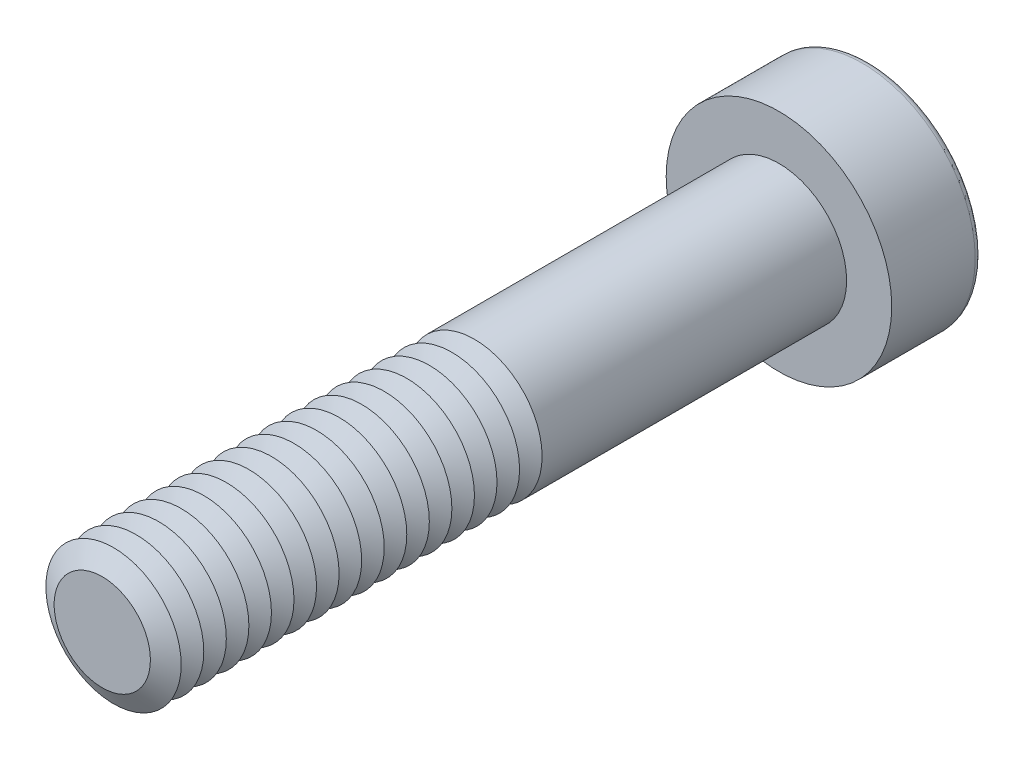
ISO-10303-21;
HEADER;
FILE_DESCRIPTION(('STEP AP214'),'2;1');
FILE_NAME('part.step','',(''),(''),'','','');
FILE_SCHEMA(('AUTOMOTIVE_DESIGN { 1 0 10303 214 1 1 1 1 }'));
ENDSEC;
DATA;
#1=APPLICATION_CONTEXT('core data for automotive mechanical design processes');
#2=APPLICATION_PROTOCOL_DEFINITION('international standard','automotive_design',2000,#1);
#3=PRODUCT_CONTEXT('',#1,'mechanical');
#4=PRODUCT('Part','Part','',(#3));
#5=PRODUCT_RELATED_PRODUCT_CATEGORY('part','',(#4));
#6=PRODUCT_DEFINITION_FORMATION('','',#4);
#7=PRODUCT_DEFINITION_CONTEXT('part definition',#1,'design');
#8=PRODUCT_DEFINITION('design','',#6,#7);
#9=PRODUCT_DEFINITION_SHAPE('','',#8);
#10=(LENGTH_UNIT() NAMED_UNIT(*) SI_UNIT(.MILLI.,.METRE.));
#11=(NAMED_UNIT(*) PLANE_ANGLE_UNIT() SI_UNIT($,.RADIAN.));
#12=(NAMED_UNIT(*) SI_UNIT($,.STERADIAN.) SOLID_ANGLE_UNIT());
#13=UNCERTAINTY_MEASURE_WITH_UNIT(LENGTH_MEASURE(1.E-05),#10,'distance_accuracy_value','');
#14=(GEOMETRIC_REPRESENTATION_CONTEXT(3) GLOBAL_UNCERTAINTY_ASSIGNED_CONTEXT((#13)) GLOBAL_UNIT_ASSIGNED_CONTEXT((#10,
#11,#12)) REPRESENTATION_CONTEXT('',''));
#15=CARTESIAN_POINT('',(0.,0.,0.));
#16=DIRECTION('',(0.,0.,1.));
#17=DIRECTION('',(1.,0.,0.));
#18=AXIS2_PLACEMENT_3D('',#15,#16,#17);
#19=CARTESIAN_POINT('',(0.,0.,26.5));
#20=DIRECTION('',(0.,0.,1.));
#21=DIRECTION('',(1.,0.,0.));
#22=AXIS2_PLACEMENT_3D('',#19,#20,#21);
#23=CONICAL_SURFACE('',#22,3.,1.0471975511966);
#24=CARTESIAN_POINT('',(0.,0.,26.));
#25=DIRECTION('',(0.,0.,1.));
#26=DIRECTION('',(1.,0.,0.));
#27=AXIS2_PLACEMENT_3D('',#24,#25,#26);
#28=CIRCLE('',#27,2.13397459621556);
#29=CARTESIAN_POINT('',(2.13397459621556,0.,26.));
#30=VERTEX_POINT('',#29);
#31=EDGE_CURVE('E313',#30,#30,#28,.T.);
#32=ORIENTED_EDGE('',*,*,#31,.T.);
#33=EDGE_LOOP('',(#32));
#34=FACE_BOUND('',#33,.T.);
#35=CARTESIAN_POINT('',(0.,0.,26.5));
#36=DIRECTION('',(0.,0.,1.));
#37=DIRECTION('',(1.,0.,0.));
#38=AXIS2_PLACEMENT_3D('',#35,#36,#37);
#39=CIRCLE('',#38,3.);
#40=CARTESIAN_POINT('',(3.,0.,26.5));
#41=VERTEX_POINT('',#40);
#42=EDGE_CURVE('E316',#41,#41,#39,.T.);
#43=ORIENTED_EDGE('',*,*,#42,.F.);
#44=EDGE_LOOP('',(#43));
#45=FACE_BOUND('',#44,.T.);
#46=ADVANCED_FACE('F39',(#34,#45),#23,.T.);
#47=CARTESIAN_POINT('',(0.,0.,26.));
#48=DIRECTION('',(0.,0.,-1.));
#49=DIRECTION('',(-1.,0.,0.));
#50=AXIS2_PLACEMENT_3D('',#47,#48,#49);
#51=CONICAL_SURFACE('',#50,2.13397459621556,1.0471975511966);
#52=CARTESIAN_POINT('',(0.,0.,25.5));
#53=DIRECTION('',(0.,0.,1.));
#54=DIRECTION('',(1.,0.,0.));
#55=AXIS2_PLACEMENT_3D('',#52,#53,#54);
#56=CIRCLE('',#55,3.);
#57=CARTESIAN_POINT('',(3.,0.,25.5));
#58=VERTEX_POINT('',#57);
#59=EDGE_CURVE('E324',#58,#58,#56,.T.);
#60=ORIENTED_EDGE('',*,*,#59,.T.);
#61=EDGE_LOOP('',(#60));
#62=FACE_BOUND('',#61,.T.);
#63=ORIENTED_EDGE('',*,*,#31,.F.);
#64=EDGE_LOOP('',(#63));
#65=FACE_BOUND('',#64,.T.);
#66=ADVANCED_FACE('F245',(#62,#65),#51,.T.);
#67=CARTESIAN_POINT('',(0.,0.,30.));
#68=DIRECTION('',(0.,0.,1.));
#69=DIRECTION('',(1.,0.,0.));
#70=AXIS2_PLACEMENT_3D('',#67,#68,#69);
#71=PLANE('',#70);
#72=CARTESIAN_POINT('',(0.,0.,30.));
#73=DIRECTION('',(0.,0.,1.));
#74=DIRECTION('',(1.,0.,0.));
#75=AXIS2_PLACEMENT_3D('',#72,#73,#74);
#76=CIRCLE('',#75,2.13397459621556);
#77=CARTESIAN_POINT('',(2.13397459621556,0.,30.));
#78=VERTEX_POINT('',#77);
#79=EDGE_CURVE('E174',#78,#78,#76,.T.);
#80=ORIENTED_EDGE('',*,*,#79,.T.);
#81=EDGE_LOOP('',(#80));
#82=FACE_BOUND('',#81,.T.);
#83=ADVANCED_FACE('F251',(#82),#71,.T.);
#84=CARTESIAN_POINT('',(0.,0.,30.));
#85=DIRECTION('',(0.,0.,-1.));
#86=DIRECTION('',(-1.,0.,0.));
#87=AXIS2_PLACEMENT_3D('',#84,#85,#86);
#88=CONICAL_SURFACE('',#87,2.13397459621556,1.0471975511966);
#89=CARTESIAN_POINT('',(0.,0.,29.5));
#90=DIRECTION('',(0.,0.,1.));
#91=DIRECTION('',(1.,0.,0.));
#92=AXIS2_PLACEMENT_3D('',#89,#90,#91);
#93=CIRCLE('',#92,3.);
#94=CARTESIAN_POINT('',(3.,0.,29.5));
#95=VERTEX_POINT('',#94);
#96=EDGE_CURVE('E291',#95,#95,#93,.T.);
#97=ORIENTED_EDGE('',*,*,#96,.T.);
#98=EDGE_LOOP('',(#97));
#99=FACE_BOUND('',#98,.T.);
#100=ORIENTED_EDGE('',*,*,#79,.F.);
#101=EDGE_LOOP('',(#100));
#102=FACE_BOUND('',#101,.T.);
#103=ADVANCED_FACE('F199',(#99,#102),#88,.T.);
#104=CARTESIAN_POINT('',(0.,0.,29.5));
#105=DIRECTION('',(0.,0.,1.));
#106=DIRECTION('',(1.,0.,0.));
#107=AXIS2_PLACEMENT_3D('',#104,#105,#106);
#108=CONICAL_SURFACE('',#107,3.,1.0471975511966);
#109=CARTESIAN_POINT('',(0.,0.,29.));
#110=DIRECTION('',(0.,0.,1.));
#111=DIRECTION('',(1.,0.,0.));
#112=AXIS2_PLACEMENT_3D('',#109,#110,#111);
#113=CIRCLE('',#112,2.13397459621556);
#114=CARTESIAN_POINT('',(2.13397459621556,0.,29.));
#115=VERTEX_POINT('',#114);
#116=EDGE_CURVE('E288',#115,#115,#113,.T.);
#117=ORIENTED_EDGE('',*,*,#116,.T.);
#118=EDGE_LOOP('',(#117));
#119=FACE_BOUND('',#118,.T.);
#120=ORIENTED_EDGE('',*,*,#96,.F.);
#121=EDGE_LOOP('',(#120));
#122=FACE_BOUND('',#121,.T.);
#123=ADVANCED_FACE('F277',(#119,#122),#108,.T.);
#124=CARTESIAN_POINT('',(0.,0.,29.));
#125=DIRECTION('',(0.,0.,-1.));
#126=DIRECTION('',(-1.,0.,0.));
#127=AXIS2_PLACEMENT_3D('',#124,#125,#126);
#128=CONICAL_SURFACE('',#127,2.13397459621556,1.0471975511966);
#129=CARTESIAN_POINT('',(0.,0.,28.5));
#130=DIRECTION('',(0.,0.,1.));
#131=DIRECTION('',(1.,0.,0.));
#132=AXIS2_PLACEMENT_3D('',#129,#130,#131);
#133=CIRCLE('',#132,3.);
#134=CARTESIAN_POINT('',(3.,0.,28.5));
#135=VERTEX_POINT('',#134);
#136=EDGE_CURVE('E299',#135,#135,#133,.T.);
#137=ORIENTED_EDGE('',*,*,#136,.T.);
#138=EDGE_LOOP('',(#137));
#139=FACE_BOUND('',#138,.T.);
#140=ORIENTED_EDGE('',*,*,#116,.F.);
#141=EDGE_LOOP('',(#140));
#142=FACE_BOUND('',#141,.T.);
#143=ADVANCED_FACE('F274',(#139,#142),#128,.T.);
#144=CARTESIAN_POINT('',(0.,0.,28.5));
#145=DIRECTION('',(0.,0.,1.));
#146=DIRECTION('',(1.,0.,0.));
#147=AXIS2_PLACEMENT_3D('',#144,#145,#146);
#148=CONICAL_SURFACE('',#147,3.,1.0471975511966);
#149=CARTESIAN_POINT('',(0.,0.,28.));
#150=DIRECTION('',(0.,0.,1.));
#151=DIRECTION('',(1.,0.,0.));
#152=AXIS2_PLACEMENT_3D('',#149,#150,#151);
#153=CIRCLE('',#152,2.13397459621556);
#154=CARTESIAN_POINT('',(2.13397459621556,0.,28.));
#155=VERTEX_POINT('',#154);
#156=EDGE_CURVE('E293',#155,#155,#153,.T.);
#157=ORIENTED_EDGE('',*,*,#156,.T.);
#158=EDGE_LOOP('',(#157));
#159=FACE_BOUND('',#158,.T.);
#160=ORIENTED_EDGE('',*,*,#136,.F.);
#161=EDGE_LOOP('',(#160));
#162=FACE_BOUND('',#161,.T.);
#163=ADVANCED_FACE('F270',(#159,#162),#148,.T.);
#164=CARTESIAN_POINT('',(0.,0.,28.));
#165=DIRECTION('',(0.,0.,-1.));
#166=DIRECTION('',(-1.,0.,0.));
#167=AXIS2_PLACEMENT_3D('',#164,#165,#166);
#168=CONICAL_SURFACE('',#167,2.13397459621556,1.0471975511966);
#169=CARTESIAN_POINT('',(0.,0.,27.5));
#170=DIRECTION('',(0.,0.,1.));
#171=DIRECTION('',(1.,0.,0.));
#172=AXIS2_PLACEMENT_3D('',#169,#170,#171);
#173=CIRCLE('',#172,3.);
#174=CARTESIAN_POINT('',(3.,0.,27.5));
#175=VERTEX_POINT('',#174);
#176=EDGE_CURVE('E309',#175,#175,#173,.T.);
#177=ORIENTED_EDGE('',*,*,#176,.T.);
#178=EDGE_LOOP('',(#177));
#179=FACE_BOUND('',#178,.T.);
#180=ORIENTED_EDGE('',*,*,#156,.F.);
#181=EDGE_LOOP('',(#180));
#182=FACE_BOUND('',#181,.T.);
#183=ADVANCED_FACE('F266',(#179,#182),#168,.T.);
#184=CARTESIAN_POINT('',(0.,0.,27.5));
#185=DIRECTION('',(0.,0.,1.));
#186=DIRECTION('',(1.,0.,0.));
#187=AXIS2_PLACEMENT_3D('',#184,#185,#186);
#188=CONICAL_SURFACE('',#187,3.,1.0471975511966);
#189=CARTESIAN_POINT('',(0.,0.,27.));
#190=DIRECTION('',(0.,0.,1.));
#191=DIRECTION('',(1.,0.,0.));
#192=AXIS2_PLACEMENT_3D('',#189,#190,#191);
#193=CIRCLE('',#192,2.13397459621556);
#194=CARTESIAN_POINT('',(2.13397459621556,0.,27.));
#195=VERTEX_POINT('',#194);
#196=EDGE_CURVE('E305',#195,#195,#193,.T.);
#197=ORIENTED_EDGE('',*,*,#196,.T.);
#198=EDGE_LOOP('',(#197));
#199=FACE_BOUND('',#198,.T.);
#200=ORIENTED_EDGE('',*,*,#176,.F.);
#201=EDGE_LOOP('',(#200));
#202=FACE_BOUND('',#201,.T.);
#203=ADVANCED_FACE('F262',(#199,#202),#188,.T.);
#204=CARTESIAN_POINT('',(0.,0.,27.));
#205=DIRECTION('',(0.,0.,-1.));
#206=DIRECTION('',(-1.,0.,0.));
#207=AXIS2_PLACEMENT_3D('',#204,#205,#206);
#208=CONICAL_SURFACE('',#207,2.13397459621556,1.0471975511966);
#209=ORIENTED_EDGE('',*,*,#42,.T.);
#210=EDGE_LOOP('',(#209));
#211=FACE_BOUND('',#210,.T.);
#212=ORIENTED_EDGE('',*,*,#196,.F.);
#213=EDGE_LOOP('',(#212));
#214=FACE_BOUND('',#213,.T.);
#215=ADVANCED_FACE('F258',(#211,#214),#208,.T.);
#216=CARTESIAN_POINT('',(0.,0.,25.5));
#217=DIRECTION('',(0.,0.,1.));
#218=DIRECTION('',(1.,0.,0.));
#219=AXIS2_PLACEMENT_3D('',#216,#217,#218);
#220=CONICAL_SURFACE('',#219,3.,1.0471975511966);
#221=CARTESIAN_POINT('',(0.,0.,25.));
#222=DIRECTION('',(0.,0.,1.));
#223=DIRECTION('',(1.,0.,0.));
#224=AXIS2_PLACEMENT_3D('',#221,#222,#223);
#225=CIRCLE('',#224,2.13397459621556);
#226=CARTESIAN_POINT('',(2.13397459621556,0.,25.));
#227=VERTEX_POINT('',#226);
#228=EDGE_CURVE('E320',#227,#227,#225,.T.);
#229=ORIENTED_EDGE('',*,*,#228,.T.);
#230=EDGE_LOOP('',(#229));
#231=FACE_BOUND('',#230,.T.);
#232=ORIENTED_EDGE('',*,*,#59,.F.);
#233=EDGE_LOOP('',(#232));
#234=FACE_BOUND('',#233,.T.);
#235=ADVANCED_FACE('F261',(#231,#234),#220,.T.);
#236=CARTESIAN_POINT('',(0.,0.,25.));
#237=DIRECTION('',(0.,0.,-1.));
#238=DIRECTION('',(-1.,0.,0.));
#239=AXIS2_PLACEMENT_3D('',#236,#237,#238);
#240=CONICAL_SURFACE('',#239,2.13397459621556,1.0471975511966);
#241=CARTESIAN_POINT('',(0.,0.,24.5));
#242=DIRECTION('',(0.,0.,1.));
#243=DIRECTION('',(1.,0.,0.));
#244=AXIS2_PLACEMENT_3D('',#241,#242,#243);
#245=CIRCLE('',#244,3.);
#246=CARTESIAN_POINT('',(3.,0.,24.5));
#247=VERTEX_POINT('',#246);
#248=EDGE_CURVE('E332',#247,#247,#245,.T.);
#249=ORIENTED_EDGE('',*,*,#248,.T.);
#250=EDGE_LOOP('',(#249));
#251=FACE_BOUND('',#250,.T.);
#252=ORIENTED_EDGE('',*,*,#228,.F.);
#253=EDGE_LOOP('',(#252));
#254=FACE_BOUND('',#253,.T.);
#255=ADVANCED_FACE('F511',(#251,#254),#240,.T.);
#256=CARTESIAN_POINT('',(0.,0.,24.5));
#257=DIRECTION('',(0.,0.,1.));
#258=DIRECTION('',(1.,0.,0.));
#259=AXIS2_PLACEMENT_3D('',#256,#257,#258);
#260=CONICAL_SURFACE('',#259,3.,1.0471975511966);
#261=CARTESIAN_POINT('',(0.,0.,24.));
#262=DIRECTION('',(0.,0.,1.));
#263=DIRECTION('',(1.,0.,0.));
#264=AXIS2_PLACEMENT_3D('',#261,#262,#263);
#265=CIRCLE('',#264,2.13397459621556);
#266=CARTESIAN_POINT('',(2.13397459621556,0.,24.));
#267=VERTEX_POINT('',#266);
#268=EDGE_CURVE('E328',#267,#267,#265,.T.);
#269=ORIENTED_EDGE('',*,*,#268,.T.);
#270=EDGE_LOOP('',(#269));
#271=FACE_BOUND('',#270,.T.);
#272=ORIENTED_EDGE('',*,*,#248,.F.);
#273=EDGE_LOOP('',(#272));
#274=FACE_BOUND('',#273,.T.);
#275=ADVANCED_FACE('F507',(#271,#274),#260,.T.);
#276=CARTESIAN_POINT('',(0.,0.,24.));
#277=DIRECTION('',(0.,0.,-1.));
#278=DIRECTION('',(-1.,0.,0.));
#279=AXIS2_PLACEMENT_3D('',#276,#277,#278);
#280=CONICAL_SURFACE('',#279,2.13397459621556,1.0471975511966);
#281=CARTESIAN_POINT('',(0.,0.,23.5));
#282=DIRECTION('',(0.,0.,1.));
#283=DIRECTION('',(1.,0.,0.));
#284=AXIS2_PLACEMENT_3D('',#281,#282,#283);
#285=CIRCLE('',#284,3.);
#286=CARTESIAN_POINT('',(3.,0.,23.5));
#287=VERTEX_POINT('',#286);
#288=EDGE_CURVE('E340',#287,#287,#285,.T.);
#289=ORIENTED_EDGE('',*,*,#288,.T.);
#290=EDGE_LOOP('',(#289));
#291=FACE_BOUND('',#290,.T.);
#292=ORIENTED_EDGE('',*,*,#268,.F.);
#293=EDGE_LOOP('',(#292));
#294=FACE_BOUND('',#293,.T.);
#295=ADVANCED_FACE('F503',(#291,#294),#280,.T.);
#296=CARTESIAN_POINT('',(0.,0.,23.5));
#297=DIRECTION('',(0.,0.,1.));
#298=DIRECTION('',(1.,0.,0.));
#299=AXIS2_PLACEMENT_3D('',#296,#297,#298);
#300=CONICAL_SURFACE('',#299,3.,1.0471975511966);
#301=CARTESIAN_POINT('',(0.,0.,23.));
#302=DIRECTION('',(0.,0.,1.));
#303=DIRECTION('',(1.,0.,0.));
#304=AXIS2_PLACEMENT_3D('',#301,#302,#303);
#305=CIRCLE('',#304,2.13397459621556);
#306=CARTESIAN_POINT('',(2.13397459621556,0.,23.));
#307=VERTEX_POINT('',#306);
#308=EDGE_CURVE('E336',#307,#307,#305,.T.);
#309=ORIENTED_EDGE('',*,*,#308,.T.);
#310=EDGE_LOOP('',(#309));
#311=FACE_BOUND('',#310,.T.);
#312=ORIENTED_EDGE('',*,*,#288,.F.);
#313=EDGE_LOOP('',(#312));
#314=FACE_BOUND('',#313,.T.);
#315=ADVANCED_FACE('F499',(#311,#314),#300,.T.);
#316=CARTESIAN_POINT('',(0.,0.,23.));
#317=DIRECTION('',(0.,0.,-1.));
#318=DIRECTION('',(-1.,0.,0.));
#319=AXIS2_PLACEMENT_3D('',#316,#317,#318);
#320=CONICAL_SURFACE('',#319,2.13397459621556,1.0471975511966);
#321=CARTESIAN_POINT('',(0.,0.,22.5));
#322=DIRECTION('',(0.,0.,1.));
#323=DIRECTION('',(1.,0.,0.));
#324=AXIS2_PLACEMENT_3D('',#321,#322,#323);
#325=CIRCLE('',#324,3.);
#326=CARTESIAN_POINT('',(3.,0.,22.5));
#327=VERTEX_POINT('',#326);
#328=EDGE_CURVE('E348',#327,#327,#325,.T.);
#329=ORIENTED_EDGE('',*,*,#328,.T.);
#330=EDGE_LOOP('',(#329));
#331=FACE_BOUND('',#330,.T.);
#332=ORIENTED_EDGE('',*,*,#308,.F.);
#333=EDGE_LOOP('',(#332));
#334=FACE_BOUND('',#333,.T.);
#335=ADVANCED_FACE('F495',(#331,#334),#320,.T.);
#336=CARTESIAN_POINT('',(0.,0.,22.5));
#337=DIRECTION('',(0.,0.,1.));
#338=DIRECTION('',(1.,0.,0.));
#339=AXIS2_PLACEMENT_3D('',#336,#337,#338);
#340=CONICAL_SURFACE('',#339,3.,1.0471975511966);
#341=CARTESIAN_POINT('',(0.,0.,22.));
#342=DIRECTION('',(0.,0.,1.));
#343=DIRECTION('',(1.,0.,0.));
#344=AXIS2_PLACEMENT_3D('',#341,#342,#343);
#345=CIRCLE('',#344,2.13397459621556);
#346=CARTESIAN_POINT('',(2.13397459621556,0.,22.));
#347=VERTEX_POINT('',#346);
#348=EDGE_CURVE('E344',#347,#347,#345,.T.);
#349=ORIENTED_EDGE('',*,*,#348,.T.);
#350=EDGE_LOOP('',(#349));
#351=FACE_BOUND('',#350,.T.);
#352=ORIENTED_EDGE('',*,*,#328,.F.);
#353=EDGE_LOOP('',(#352));
#354=FACE_BOUND('',#353,.T.);
#355=ADVANCED_FACE('F491',(#351,#354),#340,.T.);
#356=CARTESIAN_POINT('',(0.,0.,22.));
#357=DIRECTION('',(0.,0.,-1.));
#358=DIRECTION('',(-1.,0.,0.));
#359=AXIS2_PLACEMENT_3D('',#356,#357,#358);
#360=CONICAL_SURFACE('',#359,2.13397459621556,1.0471975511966);
#361=CARTESIAN_POINT('',(0.,0.,21.5));
#362=DIRECTION('',(0.,0.,1.));
#363=DIRECTION('',(1.,0.,0.));
#364=AXIS2_PLACEMENT_3D('',#361,#362,#363);
#365=CIRCLE('',#364,3.);
#366=CARTESIAN_POINT('',(3.,0.,21.5));
#367=VERTEX_POINT('',#366);
#368=EDGE_CURVE('E356',#367,#367,#365,.T.);
#369=ORIENTED_EDGE('',*,*,#368,.T.);
#370=EDGE_LOOP('',(#369));
#371=FACE_BOUND('',#370,.T.);
#372=ORIENTED_EDGE('',*,*,#348,.F.);
#373=EDGE_LOOP('',(#372));
#374=FACE_BOUND('',#373,.T.);
#375=ADVANCED_FACE('F487',(#371,#374),#360,.T.);
#376=CARTESIAN_POINT('',(0.,0.,21.5));
#377=DIRECTION('',(0.,0.,1.));
#378=DIRECTION('',(1.,0.,0.));
#379=AXIS2_PLACEMENT_3D('',#376,#377,#378);
#380=CONICAL_SURFACE('',#379,3.,1.0471975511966);
#381=CARTESIAN_POINT('',(0.,0.,21.));
#382=DIRECTION('',(0.,0.,1.));
#383=DIRECTION('',(1.,0.,0.));
#384=AXIS2_PLACEMENT_3D('',#381,#382,#383);
#385=CIRCLE('',#384,2.13397459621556);
#386=CARTESIAN_POINT('',(2.13397459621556,0.,21.));
#387=VERTEX_POINT('',#386);
#388=EDGE_CURVE('E352',#387,#387,#385,.T.);
#389=ORIENTED_EDGE('',*,*,#388,.T.);
#390=EDGE_LOOP('',(#389));
#391=FACE_BOUND('',#390,.T.);
#392=ORIENTED_EDGE('',*,*,#368,.F.);
#393=EDGE_LOOP('',(#392));
#394=FACE_BOUND('',#393,.T.);
#395=ADVANCED_FACE('F483',(#391,#394),#380,.T.);
#396=CARTESIAN_POINT('',(0.,0.,21.));
#397=DIRECTION('',(0.,0.,-1.));
#398=DIRECTION('',(-1.,0.,0.));
#399=AXIS2_PLACEMENT_3D('',#396,#397,#398);
#400=CONICAL_SURFACE('',#399,2.13397459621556,1.0471975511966);
#401=CARTESIAN_POINT('',(0.,0.,20.5));
#402=DIRECTION('',(0.,0.,1.));
#403=DIRECTION('',(1.,0.,0.));
#404=AXIS2_PLACEMENT_3D('',#401,#402,#403);
#405=CIRCLE('',#404,3.);
#406=CARTESIAN_POINT('',(3.,0.,20.5));
#407=VERTEX_POINT('',#406);
#408=EDGE_CURVE('E363',#407,#407,#405,.T.);
#409=ORIENTED_EDGE('',*,*,#408,.T.);
#410=EDGE_LOOP('',(#409));
#411=FACE_BOUND('',#410,.T.);
#412=ORIENTED_EDGE('',*,*,#388,.F.);
#413=EDGE_LOOP('',(#412));
#414=FACE_BOUND('',#413,.T.);
#415=ADVANCED_FACE('F479',(#411,#414),#400,.T.);
#416=CARTESIAN_POINT('',(0.,0.,20.5));
#417=DIRECTION('',(0.,0.,1.));
#418=DIRECTION('',(1.,0.,0.));
#419=AXIS2_PLACEMENT_3D('',#416,#417,#418);
#420=CONICAL_SURFACE('',#419,3.,1.0471975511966);
#421=CARTESIAN_POINT('',(0.,0.,20.));
#422=DIRECTION('',(0.,0.,1.));
#423=DIRECTION('',(1.,0.,0.));
#424=AXIS2_PLACEMENT_3D('',#421,#422,#423);
#425=CIRCLE('',#424,2.13397459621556);
#426=CARTESIAN_POINT('',(2.13397459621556,0.,20.));
#427=VERTEX_POINT('',#426);
#428=EDGE_CURVE('E360',#427,#427,#425,.T.);
#429=ORIENTED_EDGE('',*,*,#428,.T.);
#430=EDGE_LOOP('',(#429));
#431=FACE_BOUND('',#430,.T.);
#432=ORIENTED_EDGE('',*,*,#408,.F.);
#433=EDGE_LOOP('',(#432));
#434=FACE_BOUND('',#433,.T.);
#435=ADVANCED_FACE('F475',(#431,#434),#420,.T.);
#436=CARTESIAN_POINT('',(0.,0.,20.));
#437=DIRECTION('',(0.,0.,-1.));
#438=DIRECTION('',(-1.,0.,0.));
#439=AXIS2_PLACEMENT_3D('',#436,#437,#438);
#440=CONICAL_SURFACE('',#439,2.13397459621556,1.0471975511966);
#441=CARTESIAN_POINT('',(0.,0.,19.5));
#442=DIRECTION('',(0.,0.,1.));
#443=DIRECTION('',(1.,0.,0.));
#444=AXIS2_PLACEMENT_3D('',#441,#442,#443);
#445=CIRCLE('',#444,3.);
#446=CARTESIAN_POINT('',(3.,0.,19.5));
#447=VERTEX_POINT('',#446);
#448=EDGE_CURVE('E371',#447,#447,#445,.T.);
#449=ORIENTED_EDGE('',*,*,#448,.T.);
#450=EDGE_LOOP('',(#449));
#451=FACE_BOUND('',#450,.T.);
#452=ORIENTED_EDGE('',*,*,#428,.F.);
#453=EDGE_LOOP('',(#452));
#454=FACE_BOUND('',#453,.T.);
#455=ADVANCED_FACE('F471',(#451,#454),#440,.T.);
#456=CARTESIAN_POINT('',(0.,0.,19.5));
#457=DIRECTION('',(0.,0.,1.));
#458=DIRECTION('',(1.,0.,0.));
#459=AXIS2_PLACEMENT_3D('',#456,#457,#458);
#460=CONICAL_SURFACE('',#459,3.,1.0471975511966);
#461=CARTESIAN_POINT('',(0.,0.,19.));
#462=DIRECTION('',(0.,0.,1.));
#463=DIRECTION('',(1.,0.,0.));
#464=AXIS2_PLACEMENT_3D('',#461,#462,#463);
#465=CIRCLE('',#464,2.13397459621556);
#466=CARTESIAN_POINT('',(2.13397459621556,0.,19.));
#467=VERTEX_POINT('',#466);
#468=EDGE_CURVE('E367',#467,#467,#465,.T.);
#469=ORIENTED_EDGE('',*,*,#468,.T.);
#470=EDGE_LOOP('',(#469));
#471=FACE_BOUND('',#470,.T.);
#472=ORIENTED_EDGE('',*,*,#448,.F.);
#473=EDGE_LOOP('',(#472));
#474=FACE_BOUND('',#473,.T.);
#475=ADVANCED_FACE('F467',(#471,#474),#460,.T.);
#476=CARTESIAN_POINT('',(0.,0.,19.));
#477=DIRECTION('',(0.,0.,-1.));
#478=DIRECTION('',(-1.,0.,0.));
#479=AXIS2_PLACEMENT_3D('',#476,#477,#478);
#480=CONICAL_SURFACE('',#479,2.13397459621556,1.0471975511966);
#481=CARTESIAN_POINT('',(0.,0.,18.5));
#482=DIRECTION('',(0.,0.,1.));
#483=DIRECTION('',(1.,0.,0.));
#484=AXIS2_PLACEMENT_3D('',#481,#482,#483);
#485=CIRCLE('',#484,3.);
#486=CARTESIAN_POINT('',(3.,0.,18.5));
#487=VERTEX_POINT('',#486);
#488=EDGE_CURVE('E378',#487,#487,#485,.T.);
#489=ORIENTED_EDGE('',*,*,#488,.T.);
#490=EDGE_LOOP('',(#489));
#491=FACE_BOUND('',#490,.T.);
#492=ORIENTED_EDGE('',*,*,#468,.F.);
#493=EDGE_LOOP('',(#492));
#494=FACE_BOUND('',#493,.T.);
#495=ADVANCED_FACE('F463',(#491,#494),#480,.T.);
#496=CARTESIAN_POINT('',(0.,0.,18.5));
#497=DIRECTION('',(0.,0.,1.));
#498=DIRECTION('',(1.,0.,0.));
#499=AXIS2_PLACEMENT_3D('',#496,#497,#498);
#500=CONICAL_SURFACE('',#499,3.,1.0471975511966);
#501=CARTESIAN_POINT('',(0.,0.,18.));
#502=DIRECTION('',(0.,0.,1.));
#503=DIRECTION('',(1.,0.,0.));
#504=AXIS2_PLACEMENT_3D('',#501,#502,#503);
#505=CIRCLE('',#504,2.13397459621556);
#506=CARTESIAN_POINT('',(2.13397459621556,0.,18.));
#507=VERTEX_POINT('',#506);
#508=EDGE_CURVE('E375',#507,#507,#505,.T.);
#509=ORIENTED_EDGE('',*,*,#508,.T.);
#510=EDGE_LOOP('',(#509));
#511=FACE_BOUND('',#510,.T.);
#512=ORIENTED_EDGE('',*,*,#488,.F.);
#513=EDGE_LOOP('',(#512));
#514=FACE_BOUND('',#513,.T.);
#515=ADVANCED_FACE('F459',(#511,#514),#500,.T.);
#516=CARTESIAN_POINT('',(0.,0.,18.));
#517=DIRECTION('',(0.,0.,-1.));
#518=DIRECTION('',(-1.,0.,0.));
#519=AXIS2_PLACEMENT_3D('',#516,#517,#518);
#520=CONICAL_SURFACE('',#519,2.13397459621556,1.0471975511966);
#521=CARTESIAN_POINT('',(0.,0.,17.5));
#522=DIRECTION('',(0.,0.,1.));
#523=DIRECTION('',(1.,0.,0.));
#524=AXIS2_PLACEMENT_3D('',#521,#522,#523);
#525=CIRCLE('',#524,3.);
#526=CARTESIAN_POINT('',(3.,0.,17.5));
#527=VERTEX_POINT('',#526);
#528=EDGE_CURVE('E386',#527,#527,#525,.T.);
#529=ORIENTED_EDGE('',*,*,#528,.T.);
#530=EDGE_LOOP('',(#529));
#531=FACE_BOUND('',#530,.T.);
#532=ORIENTED_EDGE('',*,*,#508,.F.);
#533=EDGE_LOOP('',(#532));
#534=FACE_BOUND('',#533,.T.);
#535=ADVANCED_FACE('F455',(#531,#534),#520,.T.);
#536=CARTESIAN_POINT('',(0.,0.,17.5));
#537=DIRECTION('',(0.,0.,1.));
#538=DIRECTION('',(1.,0.,0.));
#539=AXIS2_PLACEMENT_3D('',#536,#537,#538);
#540=CONICAL_SURFACE('',#539,3.,1.0471975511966);
#541=CARTESIAN_POINT('',(0.,0.,17.));
#542=DIRECTION('',(0.,0.,1.));
#543=DIRECTION('',(1.,0.,0.));
#544=AXIS2_PLACEMENT_3D('',#541,#542,#543);
#545=CIRCLE('',#544,2.13397459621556);
#546=CARTESIAN_POINT('',(2.13397459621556,0.,17.));
#547=VERTEX_POINT('',#546);
#548=EDGE_CURVE('E382',#547,#547,#545,.T.);
#549=ORIENTED_EDGE('',*,*,#548,.T.);
#550=EDGE_LOOP('',(#549));
#551=FACE_BOUND('',#550,.T.);
#552=ORIENTED_EDGE('',*,*,#528,.F.);
#553=EDGE_LOOP('',(#552));
#554=FACE_BOUND('',#553,.T.);
#555=ADVANCED_FACE('F451',(#551,#554),#540,.T.);
#556=CARTESIAN_POINT('',(0.,0.,17.));
#557=DIRECTION('',(0.,0.,-1.));
#558=DIRECTION('',(-1.,0.,0.));
#559=AXIS2_PLACEMENT_3D('',#556,#557,#558);
#560=CONICAL_SURFACE('',#559,2.13397459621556,1.0471975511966);
#561=CARTESIAN_POINT('',(0.,0.,16.5));
#562=DIRECTION('',(0.,0.,1.));
#563=DIRECTION('',(1.,0.,0.));
#564=AXIS2_PLACEMENT_3D('',#561,#562,#563);
#565=CIRCLE('',#564,3.);
#566=CARTESIAN_POINT('',(3.,0.,16.5));
#567=VERTEX_POINT('',#566);
#568=EDGE_CURVE('E394',#567,#567,#565,.T.);
#569=ORIENTED_EDGE('',*,*,#568,.T.);
#570=EDGE_LOOP('',(#569));
#571=FACE_BOUND('',#570,.T.);
#572=ORIENTED_EDGE('',*,*,#548,.F.);
#573=EDGE_LOOP('',(#572));
#574=FACE_BOUND('',#573,.T.);
#575=ADVANCED_FACE('F447',(#571,#574),#560,.T.);
#576=CARTESIAN_POINT('',(0.,0.,16.5));
#577=DIRECTION('',(0.,0.,1.));
#578=DIRECTION('',(1.,0.,0.));
#579=AXIS2_PLACEMENT_3D('',#576,#577,#578);
#580=CONICAL_SURFACE('',#579,3.,1.0471975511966);
#581=CARTESIAN_POINT('',(0.,0.,16.));
#582=DIRECTION('',(0.,0.,1.));
#583=DIRECTION('',(1.,0.,0.));
#584=AXIS2_PLACEMENT_3D('',#581,#582,#583);
#585=CIRCLE('',#584,2.13397459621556);
#586=CARTESIAN_POINT('',(2.13397459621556,0.,16.));
#587=VERTEX_POINT('',#586);
#588=EDGE_CURVE('E390',#587,#587,#585,.T.);
#589=ORIENTED_EDGE('',*,*,#588,.T.);
#590=EDGE_LOOP('',(#589));
#591=FACE_BOUND('',#590,.T.);
#592=ORIENTED_EDGE('',*,*,#568,.F.);
#593=EDGE_LOOP('',(#592));
#594=FACE_BOUND('',#593,.T.);
#595=ADVANCED_FACE('F443',(#591,#594),#580,.T.);
#596=CARTESIAN_POINT('',(0.,0.,16.));
#597=DIRECTION('',(0.,0.,-1.));
#598=DIRECTION('',(-1.,0.,0.));
#599=AXIS2_PLACEMENT_3D('',#596,#597,#598);
#600=CONICAL_SURFACE('',#599,2.13397459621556,1.0471975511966);
#601=CARTESIAN_POINT('',(0.,0.,15.5));
#602=DIRECTION('',(0.,0.,1.));
#603=DIRECTION('',(1.,0.,0.));
#604=AXIS2_PLACEMENT_3D('',#601,#602,#603);
#605=CIRCLE('',#604,3.);
#606=CARTESIAN_POINT('',(3.,0.,15.5));
#607=VERTEX_POINT('',#606);
#608=EDGE_CURVE('E402',#607,#607,#605,.T.);
#609=ORIENTED_EDGE('',*,*,#608,.T.);
#610=EDGE_LOOP('',(#609));
#611=FACE_BOUND('',#610,.T.);
#612=ORIENTED_EDGE('',*,*,#588,.F.);
#613=EDGE_LOOP('',(#612));
#614=FACE_BOUND('',#613,.T.);
#615=ADVANCED_FACE('F439',(#611,#614),#600,.T.);
#616=CARTESIAN_POINT('',(0.,0.,15.5));
#617=DIRECTION('',(0.,0.,1.));
#618=DIRECTION('',(1.,0.,0.));
#619=AXIS2_PLACEMENT_3D('',#616,#617,#618);
#620=CONICAL_SURFACE('',#619,3.,1.0471975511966);
#621=CARTESIAN_POINT('',(0.,0.,15.));
#622=DIRECTION('',(0.,0.,1.));
#623=DIRECTION('',(1.,0.,0.));
#624=AXIS2_PLACEMENT_3D('',#621,#622,#623);
#625=CIRCLE('',#624,2.13397459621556);
#626=CARTESIAN_POINT('',(2.13397459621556,0.,15.));
#627=VERTEX_POINT('',#626);
#628=EDGE_CURVE('E398',#627,#627,#625,.T.);
#629=ORIENTED_EDGE('',*,*,#628,.T.);
#630=EDGE_LOOP('',(#629));
#631=FACE_BOUND('',#630,.T.);
#632=ORIENTED_EDGE('',*,*,#608,.F.);
#633=EDGE_LOOP('',(#632));
#634=FACE_BOUND('',#633,.T.);
#635=ADVANCED_FACE('F434',(#631,#634),#620,.T.);
#636=CARTESIAN_POINT('',(0.,0.,15.));
#637=DIRECTION('',(0.,0.,-1.));
#638=DIRECTION('',(-1.,0.,0.));
#639=AXIS2_PLACEMENT_3D('',#636,#637,#638);
#640=CONICAL_SURFACE('',#639,2.13397459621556,1.0471975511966);
#641=CARTESIAN_POINT('',(0.,0.,14.5));
#642=DIRECTION('',(0.,0.,1.));
#643=DIRECTION('',(1.,0.,0.));
#644=AXIS2_PLACEMENT_3D('',#641,#642,#643);
#645=CIRCLE('',#644,3.);
#646=CARTESIAN_POINT('',(3.,0.,14.5));
#647=VERTEX_POINT('',#646);
#648=EDGE_CURVE('E414',#647,#647,#645,.T.);
#649=ORIENTED_EDGE('',*,*,#648,.T.);
#650=EDGE_LOOP('',(#649));
#651=FACE_BOUND('',#650,.T.);
#652=ORIENTED_EDGE('',*,*,#628,.F.);
#653=EDGE_LOOP('',(#652));
#654=FACE_BOUND('',#653,.T.);
#655=ADVANCED_FACE('F420',(#651,#654),#640,.T.);
#656=CARTESIAN_POINT('',(0.,0.,14.5));
#657=DIRECTION('',(0.,0.,1.));
#658=DIRECTION('',(1.,0.,0.));
#659=AXIS2_PLACEMENT_3D('',#656,#657,#658);
#660=CONICAL_SURFACE('',#659,3.,1.0471975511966);
#661=CARTESIAN_POINT('',(0.,0.,14.));
#662=DIRECTION('',(0.,0.,1.));
#663=DIRECTION('',(1.,0.,0.));
#664=AXIS2_PLACEMENT_3D('',#661,#662,#663);
#665=CIRCLE('',#664,2.13397459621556);
#666=CARTESIAN_POINT('',(2.13397459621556,0.,14.));
#667=VERTEX_POINT('',#666);
#668=EDGE_CURVE('E406',#667,#667,#665,.T.);
#669=ORIENTED_EDGE('',*,*,#668,.T.);
#670=EDGE_LOOP('',(#669));
#671=FACE_BOUND('',#670,.T.);
#672=ORIENTED_EDGE('',*,*,#648,.F.);
#673=EDGE_LOOP('',(#672));
#674=FACE_BOUND('',#673,.T.);
#675=ADVANCED_FACE('F423',(#671,#674),#660,.T.);
#676=CARTESIAN_POINT('',(0.,0.,14.));
#677=DIRECTION('',(0.,0.,-1.));
#678=DIRECTION('',(-1.,0.,0.));
#679=AXIS2_PLACEMENT_3D('',#676,#677,#678);
#680=CONICAL_SURFACE('',#679,2.13397459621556,1.0471975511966);
#681=CARTESIAN_POINT('',(0.,0.,13.5));
#682=DIRECTION('',(0.,0.,1.));
#683=DIRECTION('',(1.,0.,0.));
#684=AXIS2_PLACEMENT_3D('',#681,#682,#683);
#685=CIRCLE('',#684,3.);
#686=CARTESIAN_POINT('',(3.,0.,13.5));
#687=VERTEX_POINT('',#686);
#688=EDGE_CURVE('E410',#687,#687,#685,.T.);
#689=ORIENTED_EDGE('',*,*,#688,.T.);
#690=EDGE_LOOP('',(#689));
#691=FACE_BOUND('',#690,.T.);
#692=ORIENTED_EDGE('',*,*,#668,.F.);
#693=EDGE_LOOP('',(#692));
#694=FACE_BOUND('',#693,.T.);
#695=ADVANCED_FACE('F425',(#691,#694),#680,.T.);
#696=CARTESIAN_POINT('',(0.,0.,-1.));
#697=DIRECTION('',(0.,0.,-1.));
#698=DIRECTION('',(-1.,0.,0.));
#699=AXIS2_PLACEMENT_3D('',#696,#697,#698);
#700=CONICAL_SURFACE('',#699,2.,1.0471975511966);
#701=CARTESIAN_POINT('',(0.,0.,0.154700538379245));
#702=VERTEX_POINT('',#701);
#703=VERTEX_LOOP('',#702);
#704=FACE_BOUND('',#703,.T.);
#705=CARTESIAN_POINT('',(0.,0.,-1.));
#706=DIRECTION('',(0.,0.,-1.));
#707=DIRECTION('',(-1.,0.,0.));
#708=AXIS2_PLACEMENT_3D('',#705,#706,#707);
#709=CIRCLE('',#708,2.);
#710=CARTESIAN_POINT('',(-1.73205080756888,0.999999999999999,-1.));
#711=VERTEX_POINT('',#710);
#712=CARTESIAN_POINT('',(0.,2.,-1.));
#713=VERTEX_POINT('',#712);
#714=EDGE_CURVE('E149',#711,#713,#709,.T.);
#715=ORIENTED_EDGE('',*,*,#714,.T.);
#716=CARTESIAN_POINT('',(0.,0.,-1.));
#717=DIRECTION('',(0.,0.,-1.));
#718=DIRECTION('',(-1.,0.,0.));
#719=AXIS2_PLACEMENT_3D('',#716,#717,#718);
#720=CIRCLE('',#719,2.);
#721=CARTESIAN_POINT('',(1.73205080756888,1.,-1.));
#722=VERTEX_POINT('',#721);
#723=EDGE_CURVE('E54',#713,#722,#720,.T.);
#724=ORIENTED_EDGE('',*,*,#723,.T.);
#725=CARTESIAN_POINT('',(1.73205080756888,-0.999999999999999,-1.));
#726=VERTEX_POINT('',#725);
#727=EDGE_CURVE('E1026',#722,#726,#720,.T.);
#728=ORIENTED_EDGE('',*,*,#727,.T.);
#729=CARTESIAN_POINT('',(0.,-2.,-1.));
#730=VERTEX_POINT('',#729);
#731=EDGE_CURVE('E1024',#726,#730,#720,.T.);
#732=ORIENTED_EDGE('',*,*,#731,.T.);
#733=CARTESIAN_POINT('',(-1.73205080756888,-0.999999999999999,-1.));
#734=VERTEX_POINT('',#733);
#735=EDGE_CURVE('E1018',#730,#734,#720,.T.);
#736=ORIENTED_EDGE('',*,*,#735,.T.);
#737=EDGE_CURVE('E1016',#734,#711,#720,.T.);
#738=ORIENTED_EDGE('',*,*,#737,.T.);
#739=EDGE_LOOP('',(#715,#724,#728,#732,#736,#738));
#740=FACE_BOUND('',#739,.T.);
#741=ADVANCED_FACE('F201',(#704,#740),#700,.F.);
#742=CARTESIAN_POINT('',(0.,0.,-1.));
#743=DIRECTION('',(0.,0.,-1.));
#744=DIRECTION('',(-1.,0.,0.));
#745=AXIS2_PLACEMENT_3D('',#742,#743,#744);
#746=PLANE('',#745);
#747=ORIENTED_EDGE('',*,*,#723,.F.);
#748=DIRECTION('',(1.,0.,0.));
#749=VECTOR('',#748,1.);
#750=CARTESIAN_POINT('',(-1.15470053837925,2.,-1.));
#751=LINE('',#750,#749);
#752=CARTESIAN_POINT('',(1.15470053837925,2.,-1.));
#753=VERTEX_POINT('',#752);
#754=EDGE_CURVE('E1062',#713,#753,#751,.T.);
#755=ORIENTED_EDGE('',*,*,#754,.T.);
#756=DIRECTION('',(0.5,-0.866025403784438,0.));
#757=VECTOR('',#756,1.);
#758=CARTESIAN_POINT('',(1.15470053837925,2.,-1.));
#759=LINE('',#758,#757);
#760=EDGE_CURVE('E155',#753,#722,#759,.T.);
#761=ORIENTED_EDGE('',*,*,#760,.T.);
#762=EDGE_LOOP('',(#747,#755,#761));
#763=FACE_BOUND('',#762,.T.);
#764=ADVANCED_FACE('F606',(#763),#746,.T.);
#765=ORIENTED_EDGE('',*,*,#727,.F.);
#766=CARTESIAN_POINT('',(2.3094010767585,0.,-1.));
#767=VERTEX_POINT('',#766);
#768=EDGE_CURVE('E1067',#722,#767,#759,.T.);
#769=ORIENTED_EDGE('',*,*,#768,.T.);
#770=DIRECTION('',(-0.5,-0.866025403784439,0.));
#771=VECTOR('',#770,1.);
#772=CARTESIAN_POINT('',(2.3094010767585,0.,-1.));
#773=LINE('',#772,#771);
#774=EDGE_CURVE('E1040',#767,#726,#773,.T.);
#775=ORIENTED_EDGE('',*,*,#774,.T.);
#776=EDGE_LOOP('',(#765,#769,#775));
#777=FACE_BOUND('',#776,.T.);
#778=ADVANCED_FACE('F616',(#777),#746,.T.);
#779=ORIENTED_EDGE('',*,*,#731,.F.);
#780=CARTESIAN_POINT('',(1.15470053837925,-2.,-1.));
#781=VERTEX_POINT('',#780);
#782=EDGE_CURVE('E1042',#726,#781,#773,.T.);
#783=ORIENTED_EDGE('',*,*,#782,.T.);
#784=DIRECTION('',(-1.,0.,0.));
#785=VECTOR('',#784,1.);
#786=CARTESIAN_POINT('',(1.15470053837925,-2.,-1.));
#787=LINE('',#786,#785);
#788=EDGE_CURVE('E990',#781,#730,#787,.T.);
#789=ORIENTED_EDGE('',*,*,#788,.T.);
#790=EDGE_LOOP('',(#779,#783,#789));
#791=FACE_BOUND('',#790,.T.);
#792=ADVANCED_FACE('F626',(#791),#746,.T.);
#793=ORIENTED_EDGE('',*,*,#735,.F.);
#794=CARTESIAN_POINT('',(-1.15470053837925,-2.,-1.));
#795=VERTEX_POINT('',#794);
#796=EDGE_CURVE('E1037',#730,#795,#787,.T.);
#797=ORIENTED_EDGE('',*,*,#796,.T.);
#798=DIRECTION('',(-0.5,0.866025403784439,0.));
#799=VECTOR('',#798,1.);
#800=CARTESIAN_POINT('',(-1.15470053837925,-2.,-1.));
#801=LINE('',#800,#799);
#802=EDGE_CURVE('E1039',#795,#734,#801,.T.);
#803=ORIENTED_EDGE('',*,*,#802,.T.);
#804=EDGE_LOOP('',(#793,#797,#803));
#805=FACE_BOUND('',#804,.T.);
#806=ADVANCED_FACE('F634',(#805),#746,.T.);
#807=ORIENTED_EDGE('',*,*,#737,.F.);
#808=CARTESIAN_POINT('',(-2.3094010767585,0.,-1.));
#809=VERTEX_POINT('',#808);
#810=EDGE_CURVE('E1043',#734,#809,#801,.T.);
#811=ORIENTED_EDGE('',*,*,#810,.T.);
#812=DIRECTION('',(0.5,0.866025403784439,0.));
#813=VECTOR('',#812,1.);
#814=CARTESIAN_POINT('',(-2.3094010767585,0.,-1.));
#815=LINE('',#814,#813);
#816=EDGE_CURVE('E158',#809,#711,#815,.T.);
#817=ORIENTED_EDGE('',*,*,#816,.T.);
#818=EDGE_LOOP('',(#807,#811,#817));
#819=FACE_BOUND('',#818,.T.);
#820=ADVANCED_FACE('F231',(#819),#746,.T.);
#821=ORIENTED_EDGE('',*,*,#714,.F.);
#822=CARTESIAN_POINT('',(-1.15470053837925,2.,-1.));
#823=VERTEX_POINT('',#822);
#824=EDGE_CURVE('E1050',#711,#823,#815,.T.);
#825=ORIENTED_EDGE('',*,*,#824,.T.);
#826=EDGE_CURVE('E1063',#823,#713,#751,.T.);
#827=ORIENTED_EDGE('',*,*,#826,.T.);
#828=EDGE_LOOP('',(#821,#825,#827));
#829=FACE_BOUND('',#828,.T.);
#830=ADVANCED_FACE('F618',(#829),#746,.T.);
#831=CARTESIAN_POINT('',(-1.15470053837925,2.,-1.));
#832=DIRECTION('',(0.,1.,0.));
#833=DIRECTION('',(0.,0.,1.));
#834=AXIS2_PLACEMENT_3D('',#831,#832,#833);
#835=PLANE('',#834);
#836=DIRECTION('',(0.,0.,-1.));
#837=VECTOR('',#836,1.);
#838=CARTESIAN_POINT('',(-1.15470053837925,2.,-1.));
#839=LINE('',#838,#837);
#840=CARTESIAN_POINT('',(-1.15470053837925,2.,-4.));
#841=VERTEX_POINT('',#840);
#842=EDGE_CURVE('E147',#823,#841,#839,.T.);
#843=ORIENTED_EDGE('',*,*,#842,.T.);
#844=CARTESIAN_POINT('',(-3.01440758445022,2.,-4.35051689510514));
#845=CARTESIAN_POINT('',(-2.92409762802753,2.,-4.33035636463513));
#846=CARTESIAN_POINT('',(-2.83373054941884,2.,-4.31045254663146));
#847=CARTESIAN_POINT('',(-2.65285291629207,2.,-4.27128852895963));
#848=CARTESIAN_POINT('',(-2.562342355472,2.,-4.25202835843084));
#849=CARTESIAN_POINT('',(-2.29037985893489,2.,-4.19537300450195));
#850=CARTESIAN_POINT('',(-2.10868043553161,2.,-4.15914446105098));
#851=CARTESIAN_POINT('',(-1.74597297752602,2.,-4.09171688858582));
#852=CARTESIAN_POINT('',(-1.56497266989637,2.,-4.06047686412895));
#853=CARTESIAN_POINT('',(-1.20186568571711,2.,-4.00513826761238));
#854=CARTESIAN_POINT('',(-1.01975924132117,2.,-3.98103824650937));
#855=CARTESIAN_POINT('',(-0.744747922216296,2.,-3.9525901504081));
#856=CARTESIAN_POINT('',(-0.652245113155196,2.,-3.9443671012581));
#857=CARTESIAN_POINT('',(-0.467020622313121,2.,-3.93099406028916));
#858=CARTESIAN_POINT('',(-0.374298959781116,2.,-3.92584380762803));
#859=CARTESIAN_POINT('',(-0.188764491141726,2.,-3.91891540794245));
#860=CARTESIAN_POINT('',(-0.0959517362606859,2.,-3.91713591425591));
#861=CARTESIAN_POINT('',(0.0896753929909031,2.,-3.91705786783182));
#862=CARTESIAN_POINT('',(0.182489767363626,2.,-3.91875932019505));
#863=CARTESIAN_POINT('',(0.368369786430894,2.,-3.92554892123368));
#864=CARTESIAN_POINT('',(0.461434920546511,2.,-3.93065079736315));
#865=CARTESIAN_POINT('',(0.647346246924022,2.,-3.94395663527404));
#866=CARTESIAN_POINT('',(0.740192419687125,2.,-3.95216086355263));
#867=CARTESIAN_POINT('',(1.01841374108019,2.,-3.98081777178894));
#868=CARTESIAN_POINT('',(1.2033713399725,2.,-4.00531018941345));
#869=CARTESIAN_POINT('',(1.57694396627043,2.,-4.06236202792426));
#870=CARTESIAN_POINT('',(1.76552771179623,2.,-4.09511615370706));
#871=CARTESIAN_POINT('',(2.14178491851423,2.,-4.1655706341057));
#872=CARTESIAN_POINT('',(2.32945822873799,2.,-4.20327178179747));
#873=CARTESIAN_POINT('',(2.70417911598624,2.,-4.28188312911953));
#874=CARTESIAN_POINT('',(2.89122649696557,2.,-4.32279425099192));
#875=CARTESIAN_POINT('',(3.26484478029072,2.,-4.40674298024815));
#876=CARTESIAN_POINT('',(3.45141567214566,2.,-4.44978063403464));
#877=CARTESIAN_POINT('',(3.821938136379,2.,-4.53678178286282));
#878=CARTESIAN_POINT('',(4.00589388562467,2.,-4.58072756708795));
#879=CARTESIAN_POINT('',(4.37356350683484,2.,-4.66963526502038));
#880=CARTESIAN_POINT('',(4.55727737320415,2.,-4.71459720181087));
#881=CARTESIAN_POINT('',(4.9242660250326,2.,-4.80519833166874));
#882=CARTESIAN_POINT('',(5.10754106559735,2.,-4.85083649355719));
#883=CARTESIAN_POINT('',(5.47394280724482,2.,-4.94267693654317));
#884=CARTESIAN_POINT('',(5.65706951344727,2.,-4.98887919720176));
#885=CARTESIAN_POINT('',(5.84014583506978,2.,-5.03527803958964));
#886=B_SPLINE_CURVE_WITH_KNOTS('',3,(#844,#845,#846,#847,#848,#849,#850,#851,#852,#853,#854,
#855,#856,#857,#858,#859,#860,#861,#862,#863,#864,#865,#866,#867,#868,#869,#870,#871,#872,#873,
#874,#875,#876,#877,#878,#879,#880,#881,#882,#883,#884,#885),.UNSPECIFIED.,.F.,.F.,(4,2,2,2,2,2,
2,2,2,2,2,2,2,2,2,2,2,2,2,2,4),(0.,0.277597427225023,0.555207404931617,1.11099118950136,
1.66194208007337,2.21278108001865,2.49134108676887,2.76987744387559,3.04830249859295,
3.32672796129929,3.60628428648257,3.88586463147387,4.44532615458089,5.0194589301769,
5.59368385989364,6.16807437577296,6.74247743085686,7.30986991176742,7.87727529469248,
8.44388991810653,9.01048407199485),.UNSPECIFIED.);
#887=CARTESIAN_POINT('',(1.15470053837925,2.,-4.));
#888=VERTEX_POINT('',#887);
#889=EDGE_CURVE('E124',#841,#888,#886,.T.);
#890=ORIENTED_EDGE('',*,*,#889,.T.);
#891=DIRECTION('',(0.,0.,-1.));
#892=VECTOR('',#891,1.);
#893=CARTESIAN_POINT('',(1.15470053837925,2.,-1.));
#894=LINE('',#893,#892);
#895=EDGE_CURVE('E143',#753,#888,#894,.T.);
#896=ORIENTED_EDGE('',*,*,#895,.F.);
#897=ORIENTED_EDGE('',*,*,#754,.F.);
#898=ORIENTED_EDGE('',*,*,#826,.F.);
#899=EDGE_LOOP('',(#843,#890,#896,#897,#898));
#900=FACE_BOUND('',#899,.T.);
#901=ADVANCED_FACE('F141',(#900),#835,.F.);
#902=CARTESIAN_POINT('',(1.15470053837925,2.,-1.));
#903=DIRECTION('',(0.866025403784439,0.5,0.));
#904=DIRECTION('',(-0.5,0.866025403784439,0.));
#905=AXIS2_PLACEMENT_3D('',#902,#903,#904);
#906=PLANE('',#905);
#907=ORIENTED_EDGE('',*,*,#895,.T.);
#908=CARTESIAN_POINT('',(1.15458506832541,2.0002,-4.00003094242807));
#909=CARTESIAN_POINT('',(1.20254643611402,1.91712847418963,-3.98717294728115));
#910=CARTESIAN_POINT('',(1.25059477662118,1.83390630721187,-3.97549990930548));
#911=CARTESIAN_POINT('',(1.3468611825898,1.66716800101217,-3.95499135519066));
#912=CARTESIAN_POINT('',(1.39507930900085,1.58365175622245,-3.94615699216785));
#913=CARTESIAN_POINT('',(1.49139287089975,1.41683177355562,-3.93184164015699));
#914=CARTESIAN_POINT('',(1.53948765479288,1.33352916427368,-3.92634357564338));
#915=CARTESIAN_POINT('',(1.63573857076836,1.1668176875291,-3.91897122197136));
#916=CARTESIAN_POINT('',(1.68389468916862,1.08340884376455,-3.91709623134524));
#917=CARTESIAN_POINT('',(1.78020692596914,0.916591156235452,-3.91709623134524));
#918=CARTESIAN_POINT('',(1.82836304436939,0.833182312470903,-3.91897122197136));
#919=CARTESIAN_POINT('',(1.92461396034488,0.666470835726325,-3.92634357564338));
#920=CARTESIAN_POINT('',(1.972708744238,0.583168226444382,-3.93184164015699));
#921=CARTESIAN_POINT('',(2.06902230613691,0.416348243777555,-3.94615699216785));
#922=CARTESIAN_POINT('',(2.11724043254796,0.332831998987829,-3.95499135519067));
#923=CARTESIAN_POINT('',(2.21350683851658,0.16609369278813,-3.97549990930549));
#924=CARTESIAN_POINT('',(2.26155517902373,0.0828715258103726,-3.98717294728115));
#925=CARTESIAN_POINT('',(2.30951654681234,-0.000199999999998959,-4.00003094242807));
#926=B_SPLINE_CURVE_WITH_KNOTS('',3,(#908,#909,#910,#911,#912,#913,#914,#915,#916,#917,#918,
#919,#920,#921,#922,#923,#924,#925),.UNSPECIFIED.,.F.,.F.,(4,2,2,2,2,2,2,2,4),(0.,
0.29035724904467,0.580832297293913,0.869807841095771,1.15872743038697,1.44764701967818,
1.73662256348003,2.02709761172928,2.31745486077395),.UNSPECIFIED.);
#927=CARTESIAN_POINT('',(2.3094010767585,0.,-4.));
#928=VERTEX_POINT('',#927);
#929=EDGE_CURVE('E11',#888,#928,#926,.T.);
#930=ORIENTED_EDGE('',*,*,#929,.T.);
#931=DIRECTION('',(0.,0.,-1.));
#932=VECTOR('',#931,1.);
#933=CARTESIAN_POINT('',(2.3094010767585,0.,-1.));
#934=LINE('',#933,#932);
#935=EDGE_CURVE('E157',#767,#928,#934,.T.);
#936=ORIENTED_EDGE('',*,*,#935,.F.);
#937=ORIENTED_EDGE('',*,*,#768,.F.);
#938=ORIENTED_EDGE('',*,*,#760,.F.);
#939=EDGE_LOOP('',(#907,#930,#936,#937,#938));
#940=FACE_BOUND('',#939,.T.);
#941=ADVANCED_FACE('F152',(#940),#906,.F.);
#942=CARTESIAN_POINT('',(2.3094010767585,0.,-1.));
#943=DIRECTION('',(0.866025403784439,-0.5,0.));
#944=DIRECTION('',(0.5,0.866025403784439,0.));
#945=AXIS2_PLACEMENT_3D('',#942,#943,#944);
#946=PLANE('',#945);
#947=ORIENTED_EDGE('',*,*,#935,.T.);
#948=CARTESIAN_POINT('',(2.30951654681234,0.000200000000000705,-4.00003094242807));
#949=CARTESIAN_POINT('',(2.26155517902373,-0.0828715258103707,-3.98717294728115));
#950=CARTESIAN_POINT('',(2.21350683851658,-0.166093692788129,-3.97549990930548));
#951=CARTESIAN_POINT('',(2.11724043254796,-0.332831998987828,-3.95499135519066));
#952=CARTESIAN_POINT('',(2.06902230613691,-0.416348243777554,-3.94615699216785));
#953=CARTESIAN_POINT('',(1.972708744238,-0.583168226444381,-3.93184164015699));
#954=CARTESIAN_POINT('',(1.92461396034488,-0.666470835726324,-3.92634357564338));
#955=CARTESIAN_POINT('',(1.82836304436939,-0.833182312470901,-3.91897122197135));
#956=CARTESIAN_POINT('',(1.78020692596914,-0.91659115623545,-3.91709623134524));
#957=CARTESIAN_POINT('',(1.68389468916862,-1.08340884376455,-3.91709623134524));
#958=CARTESIAN_POINT('',(1.63573857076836,-1.1668176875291,-3.91897122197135));
#959=CARTESIAN_POINT('',(1.53948765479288,-1.33352916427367,-3.92634357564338));
#960=CARTESIAN_POINT('',(1.49139287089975,-1.41683177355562,-3.93184164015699));
#961=CARTESIAN_POINT('',(1.39507930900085,-1.58365175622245,-3.94615699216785));
#962=CARTESIAN_POINT('',(1.3468611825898,-1.66716800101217,-3.95499135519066));
#963=CARTESIAN_POINT('',(1.25059477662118,-1.83390630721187,-3.97549990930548));
#964=CARTESIAN_POINT('',(1.20254643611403,-1.91712847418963,-3.98717294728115));
#965=CARTESIAN_POINT('',(1.15458506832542,-2.0002,-4.00003094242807));
#966=B_SPLINE_CURVE_WITH_KNOTS('',3,(#948,#949,#950,#951,#952,#953,#954,#955,#956,#957,#958,
#959,#960,#961,#962,#963,#964,#965),.UNSPECIFIED.,.F.,.F.,(4,2,2,2,2,2,2,2,4),(0.,
0.290357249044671,0.580832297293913,0.869807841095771,1.15872743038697,1.44764701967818,
1.73662256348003,2.02709761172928,2.31745486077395),.UNSPECIFIED.);
#967=CARTESIAN_POINT('',(1.15470053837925,-2.,-4.));
#968=VERTEX_POINT('',#967);
#969=EDGE_CURVE('E173',#928,#968,#966,.T.);
#970=ORIENTED_EDGE('',*,*,#969,.T.);
#971=DIRECTION('',(0.,0.,-1.));
#972=VECTOR('',#971,1.);
#973=CARTESIAN_POINT('',(1.15470053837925,-2.,-1.));
#974=LINE('',#973,#972);
#975=EDGE_CURVE('E985',#781,#968,#974,.T.);
#976=ORIENTED_EDGE('',*,*,#975,.F.);
#977=ORIENTED_EDGE('',*,*,#782,.F.);
#978=ORIENTED_EDGE('',*,*,#774,.F.);
#979=EDGE_LOOP('',(#947,#970,#976,#977,#978));
#980=FACE_BOUND('',#979,.T.);
#981=ADVANCED_FACE('F191',(#980),#946,.F.);
#982=CARTESIAN_POINT('',(1.15470053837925,-2.,-1.));
#983=DIRECTION('',(0.,-1.,0.));
#984=DIRECTION('',(0.,0.,-1.));
#985=AXIS2_PLACEMENT_3D('',#982,#983,#984);
#986=PLANE('',#985);
#987=ORIENTED_EDGE('',*,*,#975,.T.);
#988=CARTESIAN_POINT('',(-3.01440758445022,-2.,-4.35051689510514));
#989=CARTESIAN_POINT('',(-2.92409762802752,-2.,-4.33035636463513));
#990=CARTESIAN_POINT('',(-2.83373054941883,-2.,-4.31045254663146));
#991=CARTESIAN_POINT('',(-2.65285291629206,-2.,-4.27128852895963));
#992=CARTESIAN_POINT('',(-2.562342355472,-2.,-4.25202835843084));
#993=CARTESIAN_POINT('',(-2.29037985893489,-2.,-4.19537300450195));
#994=CARTESIAN_POINT('',(-2.10868043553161,-2.,-4.15914446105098));
#995=CARTESIAN_POINT('',(-1.74597297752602,-2.,-4.09171688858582));
#996=CARTESIAN_POINT('',(-1.56497266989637,-2.,-4.06047686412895));
#997=CARTESIAN_POINT('',(-1.20186568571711,-2.,-4.00513826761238));
#998=CARTESIAN_POINT('',(-1.01975924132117,-2.,-3.98103824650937));
#999=CARTESIAN_POINT('',(-0.744747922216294,-2.,-3.9525901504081));
#1000=CARTESIAN_POINT('',(-0.652245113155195,-2.,-3.9443671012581));
#1001=CARTESIAN_POINT('',(-0.46702062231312,-2.,-3.93099406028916));
#1002=CARTESIAN_POINT('',(-0.374298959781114,-2.,-3.92584380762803));
#1003=CARTESIAN_POINT('',(-0.188764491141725,-2.,-3.91891540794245));
#1004=CARTESIAN_POINT('',(-0.0959517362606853,-2.,-3.91713591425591));
#1005=CARTESIAN_POINT('',(0.0896753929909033,-2.,-3.91705786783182));
#1006=CARTESIAN_POINT('',(0.182489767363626,-2.,-3.91875932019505));
#1007=CARTESIAN_POINT('',(0.368369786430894,-2.,-3.92554892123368));
#1008=CARTESIAN_POINT('',(0.461434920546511,-2.,-3.93065079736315));
#1009=CARTESIAN_POINT('',(0.647346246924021,-2.,-3.94395663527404));
#1010=CARTESIAN_POINT('',(0.740192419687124,-2.,-3.95216086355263));
#1011=CARTESIAN_POINT('',(1.01841374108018,-2.,-3.98081777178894));
#1012=CARTESIAN_POINT('',(1.2033713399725,-2.,-4.00531018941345));
#1013=CARTESIAN_POINT('',(1.57694396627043,-2.,-4.06236202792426));
#1014=CARTESIAN_POINT('',(1.76552771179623,-2.,-4.09511615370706));
#1015=CARTESIAN_POINT('',(2.14178491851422,-2.,-4.1655706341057));
#1016=CARTESIAN_POINT('',(2.32945822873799,-2.,-4.20327178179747));
#1017=CARTESIAN_POINT('',(2.70417911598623,-2.,-4.28188312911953));
#1018=CARTESIAN_POINT('',(2.89122649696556,-2.,-4.32279425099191));
#1019=CARTESIAN_POINT('',(3.26484478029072,-2.,-4.40674298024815));
#1020=CARTESIAN_POINT('',(3.45141567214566,-2.,-4.44978063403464));
#1021=CARTESIAN_POINT('',(3.821938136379,-2.,-4.53678178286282));
#1022=CARTESIAN_POINT('',(4.00589388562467,-2.,-4.58072756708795));
#1023=CARTESIAN_POINT('',(4.37356350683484,-2.,-4.66963526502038));
#1024=CARTESIAN_POINT('',(4.55727737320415,-2.,-4.71459720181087));
#1025=CARTESIAN_POINT('',(4.9242660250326,-2.,-4.80519833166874));
#1026=CARTESIAN_POINT('',(5.10754106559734,-2.,-4.85083649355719));
#1027=CARTESIAN_POINT('',(5.47394280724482,-2.,-4.94267693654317));
#1028=CARTESIAN_POINT('',(5.65706951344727,-2.,-4.98887919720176));
#1029=CARTESIAN_POINT('',(5.84014583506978,-2.,-5.03527803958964));
#1030=B_SPLINE_CURVE_WITH_KNOTS('',3,(#988,#989,#990,#991,#992,#993,#994,#995,#996,#997,#998,
#999,#1000,#1001,#1002,#1003,#1004,#1005,#1006,#1007,#1008,#1009,#1010,#1011,#1012,#1013,#1014,
#1015,#1016,#1017,#1018,#1019,#1020,#1021,#1022,#1023,#1024,#1025,#1026,#1027,#1028,#1029),
.UNSPECIFIED.,.F.,.F.,(4,2,2,2,2,2,2,2,2,2,2,2,2,2,2,2,2,2,2,2,4),(0.,0.277597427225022,
0.555207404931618,1.11099118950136,1.66194208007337,2.21278108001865,2.49134108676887,
2.76987744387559,3.04830249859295,3.32672796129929,3.60628428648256,3.88586463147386,
4.44532615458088,5.01945893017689,5.59368385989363,6.16807437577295,6.74247743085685,
7.30986991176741,7.87727529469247,8.44388991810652,9.01048407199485),.UNSPECIFIED.);
#1031=CARTESIAN_POINT('',(-1.15470053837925,-2.,-4.));
#1032=VERTEX_POINT('',#1031);
#1033=EDGE_CURVE('E184',#968,#1032,#1030,.F.);
#1034=ORIENTED_EDGE('',*,*,#1033,.T.);
#1035=DIRECTION('',(0.,0.,-1.));
#1036=VECTOR('',#1035,1.);
#1037=CARTESIAN_POINT('',(-1.15470053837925,-2.,-1.));
#1038=LINE('',#1037,#1036);
#1039=EDGE_CURVE('E992',#795,#1032,#1038,.T.);
#1040=ORIENTED_EDGE('',*,*,#1039,.F.);
#1041=ORIENTED_EDGE('',*,*,#796,.F.);
#1042=ORIENTED_EDGE('',*,*,#788,.F.);
#1043=EDGE_LOOP('',(#987,#1034,#1040,#1041,#1042));
#1044=FACE_BOUND('',#1043,.T.);
#1045=ADVANCED_FACE('F234',(#1044),#986,.F.);
#1046=CARTESIAN_POINT('',(-1.15470053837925,-2.,-1.));
#1047=DIRECTION('',(-0.866025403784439,-0.5,0.));
#1048=DIRECTION('',(0.5,-0.866025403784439,0.));
#1049=AXIS2_PLACEMENT_3D('',#1046,#1047,#1048);
#1050=PLANE('',#1049);
#1051=ORIENTED_EDGE('',*,*,#1039,.T.);
#1052=CARTESIAN_POINT('',(-1.15458506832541,-2.0002,-4.00003094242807));
#1053=CARTESIAN_POINT('',(-1.20254643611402,-1.91712847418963,-3.98717294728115));
#1054=CARTESIAN_POINT('',(-1.25059477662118,-1.83390630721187,-3.97549990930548));
#1055=CARTESIAN_POINT('',(-1.34686118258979,-1.66716800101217,-3.95499135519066));
#1056=CARTESIAN_POINT('',(-1.39507930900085,-1.58365175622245,-3.94615699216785));
#1057=CARTESIAN_POINT('',(-1.49139287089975,-1.41683177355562,-3.93184164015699));
#1058=CARTESIAN_POINT('',(-1.53948765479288,-1.33352916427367,-3.92634357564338));
#1059=CARTESIAN_POINT('',(-1.63573857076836,-1.1668176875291,-3.91897122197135));
#1060=CARTESIAN_POINT('',(-1.68389468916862,-1.08340884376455,-3.91709623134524));
#1061=CARTESIAN_POINT('',(-1.78020692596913,-0.91659115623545,-3.91709623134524));
#1062=CARTESIAN_POINT('',(-1.82836304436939,-0.833182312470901,-3.91897122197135));
#1063=CARTESIAN_POINT('',(-1.92461396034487,-0.666470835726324,-3.92634357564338));
#1064=CARTESIAN_POINT('',(-1.972708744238,-0.583168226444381,-3.93184164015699));
#1065=CARTESIAN_POINT('',(-2.0690223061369,-0.416348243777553,-3.94615699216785));
#1066=CARTESIAN_POINT('',(-2.11724043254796,-0.332831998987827,-3.95499135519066));
#1067=CARTESIAN_POINT('',(-2.21350683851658,-0.166093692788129,-3.97549990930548));
#1068=CARTESIAN_POINT('',(-2.26155517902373,-0.0828715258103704,-3.98717294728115));
#1069=CARTESIAN_POINT('',(-2.30951654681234,0.000200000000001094,-4.00003094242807));
#1070=B_SPLINE_CURVE_WITH_KNOTS('',3,(#1052,#1053,#1054,#1055,#1056,#1057,#1058,#1059,#1060,
#1061,#1062,#1063,#1064,#1065,#1066,#1067,#1068,#1069),.UNSPECIFIED.,.F.,.F.,(4,2,2,2,2,2,2,2,
4),(0.,0.290357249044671,0.580832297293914,0.869807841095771,1.15872743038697,1.44764701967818,
1.73662256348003,2.02709761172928,2.31745486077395),.UNSPECIFIED.);
#1071=CARTESIAN_POINT('',(-2.3094010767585,0.,-4.));
#1072=VERTEX_POINT('',#1071);
#1073=EDGE_CURVE('E208',#1032,#1072,#1070,.T.);
#1074=ORIENTED_EDGE('',*,*,#1073,.T.);
#1075=DIRECTION('',(0.,0.,-1.));
#1076=VECTOR('',#1075,1.);
#1077=CARTESIAN_POINT('',(-2.3094010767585,0.,-1.));
#1078=LINE('',#1077,#1076);
#1079=EDGE_CURVE('E996',#809,#1072,#1078,.T.);
#1080=ORIENTED_EDGE('',*,*,#1079,.F.);
#1081=ORIENTED_EDGE('',*,*,#810,.F.);
#1082=ORIENTED_EDGE('',*,*,#802,.F.);
#1083=EDGE_LOOP('',(#1051,#1074,#1080,#1081,#1082));
#1084=FACE_BOUND('',#1083,.T.);
#1085=ADVANCED_FACE('F229',(#1084),#1050,.F.);
#1086=CARTESIAN_POINT('',(-2.3094010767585,0.,-1.));
#1087=DIRECTION('',(-0.866025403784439,0.5,0.));
#1088=DIRECTION('',(-0.5,-0.866025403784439,0.));
#1089=AXIS2_PLACEMENT_3D('',#1086,#1087,#1088);
#1090=PLANE('',#1089);
#1091=ORIENTED_EDGE('',*,*,#1079,.T.);
#1092=CARTESIAN_POINT('',(-2.30951654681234,-0.00019999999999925,-4.00003094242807));
#1093=CARTESIAN_POINT('',(-2.26155517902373,0.0828715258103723,-3.98717294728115));
#1094=CARTESIAN_POINT('',(-2.21350683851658,0.16609369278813,-3.97549990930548));
#1095=CARTESIAN_POINT('',(-2.11724043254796,0.332831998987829,-3.95499135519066));
#1096=CARTESIAN_POINT('',(-2.0690223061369,0.416348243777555,-3.94615699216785));
#1097=CARTESIAN_POINT('',(-1.972708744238,0.583168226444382,-3.93184164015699));
#1098=CARTESIAN_POINT('',(-1.92461396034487,0.666470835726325,-3.92634357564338));
#1099=CARTESIAN_POINT('',(-1.82836304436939,0.833182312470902,-3.91897122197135));
#1100=CARTESIAN_POINT('',(-1.78020692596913,0.916591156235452,-3.91709623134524));
#1101=CARTESIAN_POINT('',(-1.68389468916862,1.08340884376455,-3.91709623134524));
#1102=CARTESIAN_POINT('',(-1.63573857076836,1.1668176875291,-3.91897122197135));
#1103=CARTESIAN_POINT('',(-1.53948765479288,1.33352916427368,-3.92634357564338));
#1104=CARTESIAN_POINT('',(-1.49139287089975,1.41683177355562,-3.93184164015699));
#1105=CARTESIAN_POINT('',(-1.39507930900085,1.58365175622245,-3.94615699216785));
#1106=CARTESIAN_POINT('',(-1.3468611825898,1.66716800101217,-3.95499135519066));
#1107=CARTESIAN_POINT('',(-1.25059477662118,1.83390630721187,-3.97549990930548));
#1108=CARTESIAN_POINT('',(-1.20254643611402,1.91712847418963,-3.98717294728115));
#1109=CARTESIAN_POINT('',(-1.15458506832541,2.0002,-4.00003094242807));
#1110=B_SPLINE_CURVE_WITH_KNOTS('',3,(#1092,#1093,#1094,#1095,#1096,#1097,#1098,#1099,#1100,
#1101,#1102,#1103,#1104,#1105,#1106,#1107,#1108,#1109),.UNSPECIFIED.,.F.,.F.,(4,2,2,2,2,2,2,2,
4),(0.,0.29035724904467,0.580832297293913,0.869807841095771,1.15872743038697,1.44764701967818,
1.73662256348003,2.02709761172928,2.31745486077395),.UNSPECIFIED.);
#1111=EDGE_CURVE('E150',#1072,#841,#1110,.T.);
#1112=ORIENTED_EDGE('',*,*,#1111,.T.);
#1113=ORIENTED_EDGE('',*,*,#842,.F.);
#1114=ORIENTED_EDGE('',*,*,#824,.F.);
#1115=ORIENTED_EDGE('',*,*,#816,.F.);
#1116=EDGE_LOOP('',(#1091,#1112,#1113,#1114,#1115));
#1117=FACE_BOUND('',#1116,.T.);
#1118=ADVANCED_FACE('F197',(#1117),#1090,.F.);
#1119=CARTESIAN_POINT('',(0.,0.,-4.));
#1120=DIRECTION('',(0.,0.,-1.));
#1121=DIRECTION('',(-1.,0.,0.));
#1122=AXIS2_PLACEMENT_3D('',#1119,#1120,#1121);
#1123=CONICAL_SURFACE('',#1122,2.3094010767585,1.30899693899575);
#1124=CARTESIAN_POINT('',(0.,0.,-4.));
#1125=DIRECTION('',(0.,0.,-1.));
#1126=DIRECTION('',(-1.,0.,0.));
#1127=AXIS2_PLACEMENT_3D('',#1124,#1125,#1126);
#1128=CIRCLE('',#1127,2.3094010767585);
#1129=EDGE_CURVE('E120',#841,#888,#1128,.T.);
#1130=ORIENTED_EDGE('',*,*,#1129,.T.);
#1131=ORIENTED_EDGE('',*,*,#889,.F.);
#1132=EDGE_LOOP('',(#1130,#1131));
#1133=FACE_BOUND('',#1132,.T.);
#1134=ADVANCED_FACE('F122',(#1133),#1123,.F.);
#1135=EDGE_CURVE('E129',#888,#928,#1128,.T.);
#1136=ORIENTED_EDGE('',*,*,#1135,.T.);
#1137=ORIENTED_EDGE('',*,*,#929,.F.);
#1138=EDGE_LOOP('',(#1136,#1137));
#1139=FACE_BOUND('',#1138,.T.);
#1140=ADVANCED_FACE('F133',(#1139),#1123,.F.);
#1141=EDGE_CURVE('E164',#928,#968,#1128,.T.);
#1142=ORIENTED_EDGE('',*,*,#1141,.T.);
#1143=ORIENTED_EDGE('',*,*,#969,.F.);
#1144=EDGE_LOOP('',(#1142,#1143));
#1145=FACE_BOUND('',#1144,.T.);
#1146=ADVANCED_FACE('F699',(#1145),#1123,.F.);
#1147=EDGE_CURVE('E169',#968,#1032,#1128,.T.);
#1148=ORIENTED_EDGE('',*,*,#1147,.T.);
#1149=ORIENTED_EDGE('',*,*,#1033,.F.);
#1150=EDGE_LOOP('',(#1148,#1149));
#1151=FACE_BOUND('',#1150,.T.);
#1152=ADVANCED_FACE('F706',(#1151),#1123,.F.);
#1153=EDGE_CURVE('E67',#1032,#1072,#1128,.T.);
#1154=ORIENTED_EDGE('',*,*,#1153,.T.);
#1155=ORIENTED_EDGE('',*,*,#1073,.F.);
#1156=EDGE_LOOP('',(#1154,#1155));
#1157=FACE_BOUND('',#1156,.T.);
#1158=ADVANCED_FACE('F714',(#1157),#1123,.F.);
#1159=EDGE_CURVE('E60',#1072,#841,#1128,.T.);
#1160=ORIENTED_EDGE('',*,*,#1159,.T.);
#1161=ORIENTED_EDGE('',*,*,#1111,.F.);
#1162=EDGE_LOOP('',(#1160,#1161));
#1163=FACE_BOUND('',#1162,.T.);
#1164=ADVANCED_FACE('F198',(#1163),#1123,.F.);
#1165=CARTESIAN_POINT('',(0.,0.,-4.));
#1166=DIRECTION('',(0.,0.,-1.));
#1167=DIRECTION('',(-1.,0.,0.));
#1168=AXIS2_PLACEMENT_3D('',#1165,#1166,#1167);
#1169=PLANE('',#1168);
#1170=ORIENTED_EDGE('',*,*,#1159,.F.);
#1171=ORIENTED_EDGE('',*,*,#1153,.F.);
#1172=ORIENTED_EDGE('',*,*,#1147,.F.);
#1173=ORIENTED_EDGE('',*,*,#1141,.F.);
#1174=ORIENTED_EDGE('',*,*,#1135,.F.);
#1175=ORIENTED_EDGE('',*,*,#1129,.F.);
#1176=EDGE_LOOP('',(#1170,#1171,#1172,#1173,#1174,#1175));
#1177=FACE_BOUND('',#1176,.T.);
#1178=CARTESIAN_POINT('',(0.,0.,-4.));
#1179=DIRECTION('',(0.,0.,-1.));
#1180=DIRECTION('',(-1.,0.,0.));
#1181=AXIS2_PLACEMENT_3D('',#1178,#1179,#1180);
#1182=CIRCLE('',#1181,4.7);
#1183=CARTESIAN_POINT('',(-4.7,0.,-4.));
#1184=VERTEX_POINT('',#1183);
#1185=EDGE_CURVE('E1009',#1184,#1184,#1182,.T.);
#1186=ORIENTED_EDGE('',*,*,#1185,.T.);
#1187=EDGE_LOOP('',(#1186));
#1188=FACE_BOUND('',#1187,.T.);
#1189=ADVANCED_FACE('F161',(#1177,#1188),#1169,.T.);
#1190=CARTESIAN_POINT('',(0.,0.,-3.7));
#1191=DIRECTION('',(0.,0.,-1.));
#1192=DIRECTION('',(-1.,0.,0.));
#1193=AXIS2_PLACEMENT_3D('',#1190,#1191,#1192);
#1194=TOROIDAL_SURFACE('',#1193,4.7,0.3);
#1195=CARTESIAN_POINT('',(0.,0.,-3.7));
#1196=DIRECTION('',(0.,0.,-1.));
#1197=DIRECTION('',(-1.,0.,0.));
#1198=AXIS2_PLACEMENT_3D('',#1195,#1196,#1197);
#1199=CIRCLE('',#1198,5.);
#1200=CARTESIAN_POINT('',(-5.,0.,-3.7));
#1201=VERTEX_POINT('',#1200);
#1202=EDGE_CURVE('E1013',#1201,#1201,#1199,.F.);
#1203=ORIENTED_EDGE('',*,*,#1202,.F.);
#1204=EDGE_LOOP('',(#1203));
#1205=FACE_BOUND('',#1204,.T.);
#1206=ORIENTED_EDGE('',*,*,#1185,.F.);
#1207=EDGE_LOOP('',(#1206));
#1208=FACE_BOUND('',#1207,.T.);
#1209=ADVANCED_FACE('F41',(#1205,#1208),#1194,.T.);
#1210=CARTESIAN_POINT('',(0.,0.,-4.));
#1211=DIRECTION('',(0.,0.,1.));
#1212=DIRECTION('',(1.,0.,0.));
#1213=AXIS2_PLACEMENT_3D('',#1210,#1211,#1212);
#1214=CYLINDRICAL_SURFACE('',#1213,5.);
#1215=ORIENTED_EDGE('',*,*,#1202,.T.);
#1216=EDGE_LOOP('',(#1215));
#1217=FACE_BOUND('',#1216,.T.);
#1218=CARTESIAN_POINT('',(0.,0.,0.));
#1219=DIRECTION('',(0.,0.,-1.));
#1220=DIRECTION('',(-1.,0.,0.));
#1221=AXIS2_PLACEMENT_3D('',#1218,#1219,#1220);
#1222=CIRCLE('',#1221,5.);
#1223=CARTESIAN_POINT('',(-5.,0.,0.));
#1224=VERTEX_POINT('',#1223);
#1225=EDGE_CURVE('E1001',#1224,#1224,#1222,.T.);
#1226=ORIENTED_EDGE('',*,*,#1225,.T.);
#1227=EDGE_LOOP('',(#1226));
#1228=FACE_BOUND('',#1227,.T.);
#1229=ADVANCED_FACE('F738',(#1217,#1228),#1214,.T.);
#1230=CARTESIAN_POINT('',(0.,0.,0.));
#1231=DIRECTION('',(0.,0.,-1.));
#1232=DIRECTION('',(-1.,0.,0.));
#1233=AXIS2_PLACEMENT_3D('',#1230,#1231,#1232);
#1234=PLANE('',#1233);
#1235=CARTESIAN_POINT('',(0.,0.,0.));
#1236=DIRECTION('',(0.,0.,1.));
#1237=DIRECTION('',(1.,0.,0.));
#1238=AXIS2_PLACEMENT_3D('',#1235,#1236,#1237);
#1239=CIRCLE('',#1238,3.);
#1240=CARTESIAN_POINT('',(3.,0.,0.));
#1241=VERTEX_POINT('',#1240);
#1242=EDGE_CURVE('E1005',#1241,#1241,#1239,.T.);
#1243=ORIENTED_EDGE('',*,*,#1242,.F.);
#1244=EDGE_LOOP('',(#1243));
#1245=FACE_BOUND('',#1244,.T.);
#1246=ORIENTED_EDGE('',*,*,#1225,.F.);
#1247=EDGE_LOOP('',(#1246));
#1248=FACE_BOUND('',#1247,.T.);
#1249=ADVANCED_FACE('F746',(#1245,#1248),#1234,.F.);
#1250=CARTESIAN_POINT('',(0.,0.,30.));
#1251=DIRECTION('',(0.,0.,-1.));
#1252=DIRECTION('',(-1.,0.,0.));
#1253=AXIS2_PLACEMENT_3D('',#1250,#1251,#1252);
#1254=CYLINDRICAL_SURFACE('',#1253,3.);
#1255=ORIENTED_EDGE('',*,*,#1242,.T.);
#1256=EDGE_LOOP('',(#1255));
#1257=FACE_BOUND('',#1256,.T.);
#1258=ORIENTED_EDGE('',*,*,#688,.F.);
#1259=EDGE_LOOP('',(#1258));
#1260=FACE_BOUND('',#1259,.T.);
#1261=ADVANCED_FACE('F755',(#1257,#1260),#1254,.T.);
#1262=CLOSED_SHELL('',(#46,#66,#83,#103,#123,#143,#163,#183,#203,#215,#235,#255,#275,#295,#315,
#335,#355,#375,#395,#415,#435,#455,#475,#495,#515,#535,#555,#575,#595,#615,#635,#655,#675,#695,
#741,#764,#778,#792,#806,#820,#830,#901,#941,#981,#1045,#1085,#1118,#1134,#1140,#1146,#1152,
#1158,#1164,#1189,#1209,#1229,#1249,#1261));
#1263=MANIFOLD_SOLID_BREP('B2',#1262);
#1264=ADVANCED_BREP_SHAPE_REPRESENTATION('',(#18,#1263),#14);
#1265=SHAPE_DEFINITION_REPRESENTATION(#9,#1264);
ENDSEC;
END-ISO-10303-21;
